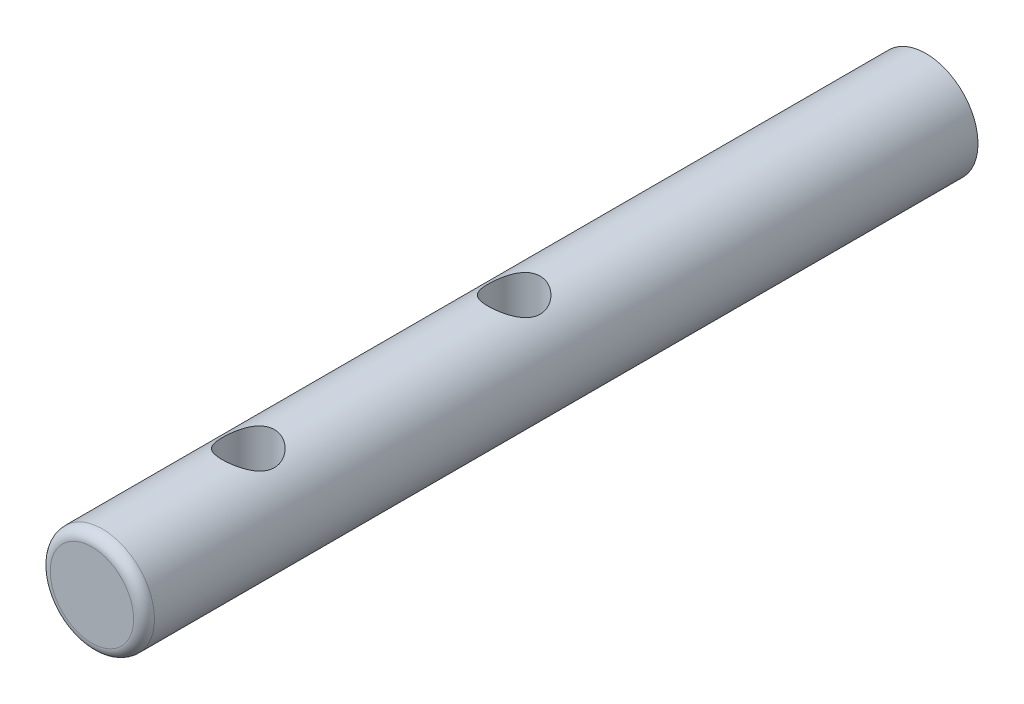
from build123d import *

# Parameters (mm, degrees)
SKETCH1_R             = 6.35
BOSS_EXTRUDE1_DEPTH   = 101.6
M5_TAPPED_HOLE1_D     = 4.2
M5_TAPPED_HOLE1_DEPTH = 25.4
M5_TAPPED_HOLE1_TIP   = 1.2618073
FILLET1_R             = 1.27
SKETCH8_R             = 3.175
CUT_EXTRUDE1_DEPTH    = 103.587389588


with BuildPart() as part:
    # Sketch1 → Boss-Extrude1 (new body)
    with BuildSketch(Plane.XY):
        Circle(SKETCH1_R)
    extrude(amount=BOSS_EXTRUDE1_DEPTH)

    # M5 Tapped Hole1
    with Locations(Plane(origin=(0, 0, 0), x_dir=(-1, 0, 0), z_dir=(0, 0, -1))):
        with Locations((0, 0)):
            Hole(M5_TAPPED_HOLE1_D / 2, depth=M5_TAPPED_HOLE1_DEPTH)
            with Locations((0, 0, -(M5_TAPPED_HOLE1_DEPTH + M5_TAPPED_HOLE1_TIP / 2))):  # 118° drill point
                Cone(0, M5_TAPPED_HOLE1_D / 2, M5_TAPPED_HOLE1_TIP, mode=Mode.SUBTRACT)

    # Fillet1
    fillet1_edges = [part.edges().sort_by_distance(p)[0] for p in [
        (-6.35, 0, 101.6),
    ]]
    fillet(fillet1_edges, radius=FILLET1_R)

    # Sketch8 → Cut-Extrude1 (cut, through all)
    with BuildSketch(Plane(origin=(0, -6.35, 0), x_dir=(-1, 0, 0), z_dir=(0, -1, 0))):
        with Locations(Location((0, -50.165, 0), (0, 0, 90))):
            Circle(SKETCH8_R)
        with Locations(Location((0, -82.55, 0), (0, 0, 90))):
            Circle(SKETCH8_R)
    extrude(amount=-CUT_EXTRUDE1_DEPTH, mode=Mode.SUBTRACT)


solid = part.part
